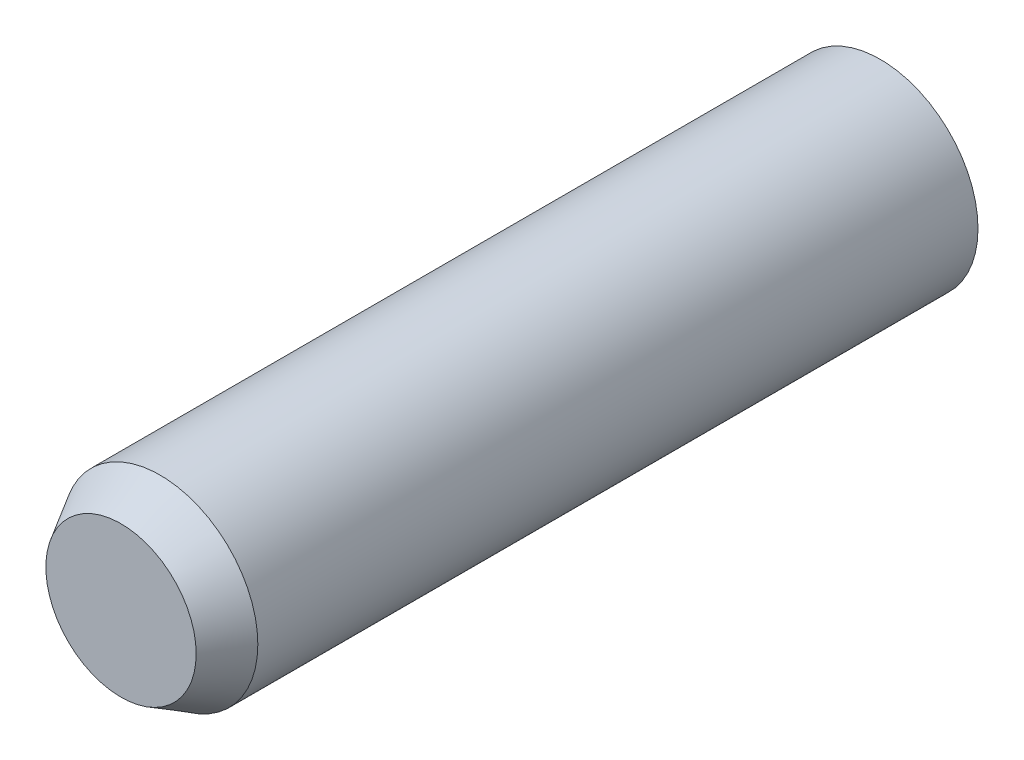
from build123d import *
from OCP.BRepFilletAPI import BRepFilletAPI_MakeChamfer

# Parameters (mm, degrees)
SKETCH1_R           = 6.35
BOSS_EXTRUDE1_DEPTH = 50.8
CHAMFER1_SIZE       = 2.54
CHAMFER1_SIZE2      = 1.466469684


with BuildPart() as part:
    # Sketch1 → Boss-Extrude1 (new body)
    with BuildSketch(Plane.XY):
        Circle(SKETCH1_R)
    extrude(amount=BOSS_EXTRUDE1_DEPTH)

    # Chamfer1: one chamfer whose edges measure the first distance from different faces: ONE call of the kernel's chamfer builder (chamfer() names one face for all edges)
    chamfer1_edges_1 = [part.edges().sort_by_distance(p)[0] for p in [
        (-6.35, 0, 0),
    ]]
    chamfer1_side_1 = [part.faces().sort_by_distance(p)[0] for p in [
        (0, 0, 0),
    ]]
    chamfer1_edges_2 = [part.edges().sort_by_distance(p)[0] for p in [
        (-6.35, 0, 50.8),
    ]]
    chamfer1_side_2 = [part.faces().sort_by_distance(p)[0] for p in [
        (-6.35, 0, 25.4),
    ]]
    chamfer1 = BRepFilletAPI_MakeChamfer(part.part.solid().wrapped)
    for e in chamfer1_edges_1:
        chamfer1.Add(CHAMFER1_SIZE, CHAMFER1_SIZE2, e.wrapped, chamfer1_side_1[0].wrapped)  # the first distance lies on this face
    for e in chamfer1_edges_2:
        chamfer1.Add(CHAMFER1_SIZE, CHAMFER1_SIZE2, e.wrapped, chamfer1_side_2[0].wrapped)  # the first distance lies on this face
    add(Compound.cast(chamfer1.Shape()), mode=Mode.REPLACE)


solid = part.part
